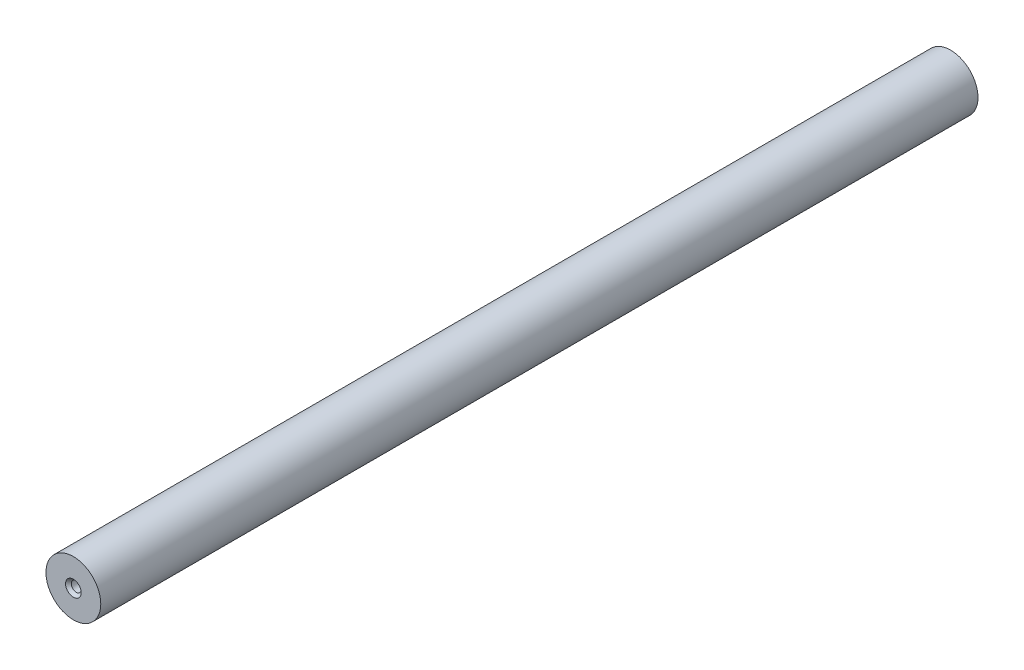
ISO-10303-21;
HEADER;
FILE_DESCRIPTION(('STEP AP214'),'2;1');
FILE_NAME('part.step','',(''),(''),'','','');
FILE_SCHEMA(('AUTOMOTIVE_DESIGN { 1 0 10303 214 1 1 1 1 }'));
ENDSEC;
DATA;
#1=APPLICATION_CONTEXT('core data for automotive mechanical design processes');
#2=APPLICATION_PROTOCOL_DEFINITION('international standard','automotive_design',2000,#1);
#3=PRODUCT_CONTEXT('',#1,'mechanical');
#4=PRODUCT('Part','Part','',(#3));
#5=PRODUCT_RELATED_PRODUCT_CATEGORY('part','',(#4));
#6=PRODUCT_DEFINITION_FORMATION('','',#4);
#7=PRODUCT_DEFINITION_CONTEXT('part definition',#1,'design');
#8=PRODUCT_DEFINITION('design','',#6,#7);
#9=PRODUCT_DEFINITION_SHAPE('','',#8);
#10=(LENGTH_UNIT() NAMED_UNIT(*) SI_UNIT(.MILLI.,.METRE.));
#11=(NAMED_UNIT(*) PLANE_ANGLE_UNIT() SI_UNIT($,.RADIAN.));
#12=(NAMED_UNIT(*) SI_UNIT($,.STERADIAN.) SOLID_ANGLE_UNIT());
#13=UNCERTAINTY_MEASURE_WITH_UNIT(LENGTH_MEASURE(1.E-05),#10,'distance_accuracy_value','');
#14=(GEOMETRIC_REPRESENTATION_CONTEXT(3) GLOBAL_UNCERTAINTY_ASSIGNED_CONTEXT((#13)) GLOBAL_UNIT_ASSIGNED_CONTEXT((#10,
#11,#12)) REPRESENTATION_CONTEXT('',''));
#15=CARTESIAN_POINT('',(0.,0.,0.));
#16=DIRECTION('',(0.,0.,1.));
#17=DIRECTION('',(1.,0.,0.));
#18=AXIS2_PLACEMENT_3D('',#15,#16,#17);
#19=CARTESIAN_POINT('',(-17.8566982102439,5.70677984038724,-304.8));
#20=DIRECTION('',(0.,0.,1.));
#21=DIRECTION('',(1.,0.,0.));
#22=AXIS2_PLACEMENT_3D('',#19,#20,#21);
#23=CYLINDRICAL_SURFACE('',#22,9.525);
#24=CARTESIAN_POINT('',(-17.8566982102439,5.70677984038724,-304.8));
#25=DIRECTION('',(0.,0.,1.));
#26=DIRECTION('',(1.,0.,0.));
#27=AXIS2_PLACEMENT_3D('',#24,#25,#26);
#28=CIRCLE('',#27,9.525);
#29=CARTESIAN_POINT('',(-8.33169821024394,5.70677984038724,-304.8));
#30=VERTEX_POINT('',#29);
#31=EDGE_CURVE('E11',#30,#30,#28,.T.);
#32=CARTESIAN_POINT('',(-17.8566982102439,5.70677984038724,0.));
#33=DIRECTION('',(0.,0.,1.));
#34=DIRECTION('',(1.,0.,0.));
#35=AXIS2_PLACEMENT_3D('',#32,#33,#34);
#36=CIRCLE('',#35,9.525);
#37=CARTESIAN_POINT('',(-8.33169821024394,5.70677984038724,0.));
#38=VERTEX_POINT('',#37);
#39=EDGE_CURVE('E49',#38,#38,#36,.T.);
#40=CARTESIAN_POINT('',(-8.33169821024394,5.70677984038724,-304.8));
#41=CARTESIAN_POINT('',(-8.33169821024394,5.70677984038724,-301.625));
#42=CARTESIAN_POINT('',(-8.33169821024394,5.70677984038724,-298.45));
#43=CARTESIAN_POINT('',(-8.33169821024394,5.70677984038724,-292.1));
#44=CARTESIAN_POINT('',(-8.33169821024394,5.70677984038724,-288.925));
#45=CARTESIAN_POINT('',(-8.33169821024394,5.70677984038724,-282.575));
#46=CARTESIAN_POINT('',(-8.33169821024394,5.70677984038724,-279.4));
#47=CARTESIAN_POINT('',(-8.33169821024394,5.70677984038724,-273.05));
#48=CARTESIAN_POINT('',(-8.33169821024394,5.70677984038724,-269.875));
#49=CARTESIAN_POINT('',(-8.33169821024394,5.70677984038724,-263.525));
#50=CARTESIAN_POINT('',(-8.33169821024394,5.70677984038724,-260.35));
#51=CARTESIAN_POINT('',(-8.33169821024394,5.70677984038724,-254.));
#52=CARTESIAN_POINT('',(-8.33169821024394,5.70677984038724,-250.825));
#53=CARTESIAN_POINT('',(-8.33169821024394,5.70677984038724,-244.475));
#54=CARTESIAN_POINT('',(-8.33169821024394,5.70677984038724,-241.3));
#55=CARTESIAN_POINT('',(-8.33169821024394,5.70677984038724,-234.95));
#56=CARTESIAN_POINT('',(-8.33169821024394,5.70677984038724,-231.775));
#57=CARTESIAN_POINT('',(-8.33169821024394,5.70677984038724,-225.425));
#58=CARTESIAN_POINT('',(-8.33169821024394,5.70677984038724,-222.25));
#59=CARTESIAN_POINT('',(-8.33169821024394,5.70677984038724,-215.9));
#60=CARTESIAN_POINT('',(-8.33169821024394,5.70677984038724,-212.725));
#61=CARTESIAN_POINT('',(-8.33169821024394,5.70677984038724,-206.375));
#62=CARTESIAN_POINT('',(-8.33169821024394,5.70677984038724,-203.2));
#63=CARTESIAN_POINT('',(-8.33169821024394,5.70677984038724,-196.85));
#64=CARTESIAN_POINT('',(-8.33169821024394,5.70677984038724,-193.675));
#65=CARTESIAN_POINT('',(-8.33169821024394,5.70677984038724,-187.325));
#66=CARTESIAN_POINT('',(-8.33169821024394,5.70677984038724,-184.15));
#67=CARTESIAN_POINT('',(-8.33169821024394,5.70677984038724,-177.8));
#68=CARTESIAN_POINT('',(-8.33169821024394,5.70677984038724,-174.625));
#69=CARTESIAN_POINT('',(-8.33169821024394,5.70677984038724,-168.275));
#70=CARTESIAN_POINT('',(-8.33169821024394,5.70677984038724,-165.1));
#71=CARTESIAN_POINT('',(-8.33169821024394,5.70677984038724,-158.75));
#72=CARTESIAN_POINT('',(-8.33169821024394,5.70677984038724,-155.575));
#73=CARTESIAN_POINT('',(-8.33169821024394,5.70677984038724,-149.225));
#74=CARTESIAN_POINT('',(-8.33169821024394,5.70677984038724,-146.05));
#75=CARTESIAN_POINT('',(-8.33169821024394,5.70677984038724,-139.7));
#76=CARTESIAN_POINT('',(-8.33169821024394,5.70677984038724,-136.525));
#77=CARTESIAN_POINT('',(-8.33169821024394,5.70677984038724,-130.175));
#78=CARTESIAN_POINT('',(-8.33169821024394,5.70677984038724,-127.));
#79=CARTESIAN_POINT('',(-8.33169821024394,5.70677984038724,-120.65));
#80=CARTESIAN_POINT('',(-8.33169821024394,5.70677984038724,-117.475));
#81=CARTESIAN_POINT('',(-8.33169821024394,5.70677984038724,-111.125));
#82=CARTESIAN_POINT('',(-8.33169821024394,5.70677984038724,-107.95));
#83=CARTESIAN_POINT('',(-8.33169821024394,5.70677984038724,-101.6));
#84=CARTESIAN_POINT('',(-8.33169821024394,5.70677984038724,-98.425));
#85=CARTESIAN_POINT('',(-8.33169821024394,5.70677984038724,-92.075));
#86=CARTESIAN_POINT('',(-8.33169821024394,5.70677984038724,-88.9));
#87=CARTESIAN_POINT('',(-8.33169821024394,5.70677984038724,-82.55));
#88=CARTESIAN_POINT('',(-8.33169821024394,5.70677984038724,-79.375));
#89=CARTESIAN_POINT('',(-8.33169821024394,5.70677984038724,-73.025));
#90=CARTESIAN_POINT('',(-8.33169821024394,5.70677984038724,-69.85));
#91=CARTESIAN_POINT('',(-8.33169821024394,5.70677984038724,-63.5));
#92=CARTESIAN_POINT('',(-8.33169821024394,5.70677984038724,-60.325));
#93=CARTESIAN_POINT('',(-8.33169821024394,5.70677984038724,-53.975));
#94=CARTESIAN_POINT('',(-8.33169821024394,5.70677984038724,-50.8));
#95=CARTESIAN_POINT('',(-8.33169821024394,5.70677984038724,-44.45));
#96=CARTESIAN_POINT('',(-8.33169821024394,5.70677984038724,-41.275));
#97=CARTESIAN_POINT('',(-8.33169821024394,5.70677984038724,-34.925));
#98=CARTESIAN_POINT('',(-8.33169821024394,5.70677984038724,-31.75));
#99=CARTESIAN_POINT('',(-8.33169821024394,5.70677984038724,-25.4));
#100=CARTESIAN_POINT('',(-8.33169821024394,5.70677984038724,-22.225));
#101=CARTESIAN_POINT('',(-8.33169821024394,5.70677984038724,-15.875));
#102=CARTESIAN_POINT('',(-8.33169821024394,5.70677984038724,-12.7));
#103=CARTESIAN_POINT('',(-8.33169821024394,5.70677984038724,-6.35));
#104=CARTESIAN_POINT('',(-8.33169821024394,5.70677984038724,-3.175));
#105=CARTESIAN_POINT('',(-8.33169821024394,5.70677984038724,0.));
#106=B_SPLINE_CURVE_WITH_KNOTS('',3,(#40,#41,#42,#43,#44,#45,#46,#47,#48,#49,#50,#51,#52,#53,
#54,#55,#56,#57,#58,#59,#60,#61,#62,#63,#64,#65,#66,#67,#68,#69,#70,#71,#72,#73,#74,#75,#76,#77,
#78,#79,#80,#81,#82,#83,#84,#85,#86,#87,#88,#89,#90,#91,#92,#93,#94,#95,#96,#97,#98,#99,#100,
#101,#102,#103,#104,#105),.UNSPECIFIED.,.F.,.F.,(4,2,2,2,2,2,2,2,2,2,2,2,2,2,2,2,2,2,2,2,2,2,2,
2,2,2,2,2,2,2,2,2,4),(0.,9.52500000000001,19.05,28.575,38.1,47.625,57.15,66.675,76.2,
85.7250000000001,95.2500000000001,104.775,114.3,123.825,133.35,142.875,152.4,161.925,171.45,
180.975,190.5,200.025,209.55,219.075,228.6,238.125,247.65,257.175,266.7,276.225,285.75,295.275,
304.8),.UNSPECIFIED.);
#107=EDGE_CURVE('BSEAM46',#30,#38,#106,.T.);
#108=ORIENTED_EDGE('',*,*,#31,.T.);
#109=ORIENTED_EDGE('',*,*,#39,.F.);
#110=ORIENTED_EDGE('',*,*,#107,.T.);
#111=ORIENTED_EDGE('',*,*,#107,.F.);
#112=EDGE_LOOP('',(#108,#110,#109,#111));
#113=FACE_BOUND('',#112,.T.);
#114=ADVANCED_FACE('F46',(#113),#23,.T.);
#115=CARTESIAN_POINT('',(-17.8566982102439,5.70677984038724,-304.8));
#116=DIRECTION('',(0.,0.,1.));
#117=DIRECTION('',(1.,0.,0.));
#118=AXIS2_PLACEMENT_3D('',#115,#116,#117);
#119=PLANE('',#118);
#120=CARTESIAN_POINT('',(-17.8566982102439,5.70677984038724,-304.8));
#121=DIRECTION('',(0.,0.,-1.));
#122=DIRECTION('',(-1.,0.,0.));
#123=AXIS2_PLACEMENT_3D('',#120,#121,#122);
#124=CIRCLE('',#123,2.7178);
#125=CARTESIAN_POINT('',(-20.5744982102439,5.70677984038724,-304.8));
#126=VERTEX_POINT('',#125);
#127=EDGE_CURVE('E81',#126,#126,#124,.T.);
#128=ORIENTED_EDGE('',*,*,#127,.F.);
#129=EDGE_LOOP('',(#128));
#130=FACE_BOUND('',#129,.T.);
#131=ORIENTED_EDGE('',*,*,#31,.F.);
#132=EDGE_LOOP('',(#131));
#133=FACE_BOUND('',#132,.T.);
#134=ADVANCED_FACE('F102',(#130,#133),#119,.F.);
#135=CARTESIAN_POINT('',(-17.8566982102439,5.70677984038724,0.));
#136=DIRECTION('',(0.,0.,1.));
#137=DIRECTION('',(1.,0.,0.));
#138=AXIS2_PLACEMENT_3D('',#135,#136,#137);
#139=PLANE('',#138);
#140=CARTESIAN_POINT('',(-17.8566982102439,5.70677984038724,0.));
#141=DIRECTION('',(0.,0.,1.));
#142=DIRECTION('',(1.,0.,0.));
#143=AXIS2_PLACEMENT_3D('',#140,#141,#142);
#144=CIRCLE('',#143,2.7178);
#145=CARTESIAN_POINT('',(-15.1388982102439,5.70677984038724,0.));
#146=VERTEX_POINT('',#145);
#147=EDGE_CURVE('E71',#146,#146,#144,.T.);
#148=ORIENTED_EDGE('',*,*,#147,.F.);
#149=EDGE_LOOP('',(#148));
#150=FACE_BOUND('',#149,.T.);
#151=ORIENTED_EDGE('',*,*,#39,.T.);
#152=EDGE_LOOP('',(#151));
#153=FACE_BOUND('',#152,.T.);
#154=ADVANCED_FACE('F99',(#150,#153),#139,.T.);
#155=CARTESIAN_POINT('',(-17.8566982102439,5.70677984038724,-12.7));
#156=DIRECTION('',(0.,0.,1.));
#157=DIRECTION('',(1.,0.,0.));
#158=AXIS2_PLACEMENT_3D('',#155,#156,#157);
#159=CONICAL_SURFACE('',#158,1.7272,1.02974425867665);
#160=CARTESIAN_POINT('',(-17.8566982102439,5.70677984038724,-13.7378064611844));
#161=VERTEX_POINT('',#160);
#162=VERTEX_LOOP('',#161);
#163=FACE_BOUND('',#162,.T.);
#164=CARTESIAN_POINT('',(-17.8566982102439,5.70677984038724,-12.7));
#165=DIRECTION('',(0.,0.,1.));
#166=DIRECTION('',(1.,0.,0.));
#167=AXIS2_PLACEMENT_3D('',#164,#165,#166);
#168=CIRCLE('',#167,1.7272);
#169=CARTESIAN_POINT('',(-16.1294982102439,5.70677984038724,-12.7));
#170=VERTEX_POINT('',#169);
#171=EDGE_CURVE('E88',#170,#170,#168,.T.);
#172=ORIENTED_EDGE('',*,*,#171,.T.);
#173=EDGE_LOOP('',(#172));
#174=FACE_BOUND('',#173,.T.);
#175=ADVANCED_FACE('F114',(#163,#174),#159,.F.);
#176=CARTESIAN_POINT('',(-17.8566982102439,5.70677984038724,0.));
#177=DIRECTION('',(0.,0.,1.));
#178=DIRECTION('',(1.,0.,0.));
#179=AXIS2_PLACEMENT_3D('',#176,#177,#178);
#180=CYLINDRICAL_SURFACE('',#179,1.7272);
#181=ORIENTED_EDGE('',*,*,#171,.F.);
#182=EDGE_LOOP('',(#181));
#183=FACE_BOUND('',#182,.T.);
#184=CARTESIAN_POINT('',(-17.8566982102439,5.70677984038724,-0.990600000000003));
#185=DIRECTION('',(0.,0.,1.));
#186=DIRECTION('',(1.,0.,0.));
#187=AXIS2_PLACEMENT_3D('',#184,#185,#186);
#188=CIRCLE('',#187,1.7272);
#189=CARTESIAN_POINT('',(-16.1294982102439,5.70677984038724,-0.990600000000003));
#190=VERTEX_POINT('',#189);
#191=EDGE_CURVE('E78',#190,#190,#188,.T.);
#192=ORIENTED_EDGE('',*,*,#191,.T.);
#193=EDGE_LOOP('',(#192));
#194=FACE_BOUND('',#193,.T.);
#195=ADVANCED_FACE('F120',(#183,#194),#180,.F.);
#196=CARTESIAN_POINT('',(-17.8566982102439,5.70677984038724,0.));
#197=DIRECTION('',(0.,0.,1.));
#198=DIRECTION('',(1.,0.,0.));
#199=AXIS2_PLACEMENT_3D('',#196,#197,#198);
#200=CONICAL_SURFACE('',#199,2.7178,0.785398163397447);
#201=ORIENTED_EDGE('',*,*,#191,.F.);
#202=EDGE_LOOP('',(#201));
#203=FACE_BOUND('',#202,.T.);
#204=ORIENTED_EDGE('',*,*,#147,.T.);
#205=EDGE_LOOP('',(#204));
#206=FACE_BOUND('',#205,.T.);
#207=ADVANCED_FACE('F64',(#203,#206),#200,.F.);
#208=CARTESIAN_POINT('',(-17.8566982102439,5.70677984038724,-292.1));
#209=DIRECTION('',(0.,0.,-1.));
#210=DIRECTION('',(-1.,0.,0.));
#211=AXIS2_PLACEMENT_3D('',#208,#209,#210);
#212=CONICAL_SURFACE('',#211,1.7272,1.02974425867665);
#213=CARTESIAN_POINT('',(-17.8566982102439,5.70677984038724,-291.062193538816));
#214=VERTEX_POINT('',#213);
#215=VERTEX_LOOP('',#214);
#216=FACE_BOUND('',#215,.T.);
#217=CARTESIAN_POINT('',(-17.8566982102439,5.70677984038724,-292.1));
#218=DIRECTION('',(0.,0.,-1.));
#219=DIRECTION('',(-1.,0.,0.));
#220=AXIS2_PLACEMENT_3D('',#217,#218,#219);
#221=CIRCLE('',#220,1.7272);
#222=CARTESIAN_POINT('',(-19.5838982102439,5.70677984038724,-292.1));
#223=VERTEX_POINT('',#222);
#224=EDGE_CURVE('E68',#223,#223,#221,.T.);
#225=ORIENTED_EDGE('',*,*,#224,.T.);
#226=EDGE_LOOP('',(#225));
#227=FACE_BOUND('',#226,.T.);
#228=ADVANCED_FACE('F60',(#216,#227),#212,.F.);
#229=CARTESIAN_POINT('',(-17.8566982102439,5.70677984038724,-304.8));
#230=DIRECTION('',(0.,0.,-1.));
#231=DIRECTION('',(-1.,0.,0.));
#232=AXIS2_PLACEMENT_3D('',#229,#230,#231);
#233=CYLINDRICAL_SURFACE('',#232,1.72719999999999);
#234=ORIENTED_EDGE('',*,*,#224,.F.);
#235=EDGE_LOOP('',(#234));
#236=FACE_BOUND('',#235,.T.);
#237=CARTESIAN_POINT('',(-17.8566982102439,5.70677984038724,-303.8094));
#238=DIRECTION('',(0.,0.,-1.));
#239=DIRECTION('',(-1.,0.,0.));
#240=AXIS2_PLACEMENT_3D('',#237,#238,#239);
#241=CIRCLE('',#240,1.72719999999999);
#242=CARTESIAN_POINT('',(-19.5838982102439,5.70677984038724,-303.8094));
#243=VERTEX_POINT('',#242);
#244=EDGE_CURVE('E72',#243,#243,#241,.T.);
#245=ORIENTED_EDGE('',*,*,#244,.T.);
#246=EDGE_LOOP('',(#245));
#247=FACE_BOUND('',#246,.T.);
#248=ADVANCED_FACE('F63',(#236,#247),#233,.F.);
#249=CARTESIAN_POINT('',(-17.8566982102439,5.70677984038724,-304.8));
#250=DIRECTION('',(0.,0.,-1.));
#251=DIRECTION('',(-1.,0.,0.));
#252=AXIS2_PLACEMENT_3D('',#249,#250,#251);
#253=CONICAL_SURFACE('',#252,2.7178,0.785398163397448);
#254=ORIENTED_EDGE('',*,*,#244,.F.);
#255=EDGE_LOOP('',(#254));
#256=FACE_BOUND('',#255,.T.);
#257=ORIENTED_EDGE('',*,*,#127,.T.);
#258=EDGE_LOOP('',(#257));
#259=FACE_BOUND('',#258,.T.);
#260=ADVANCED_FACE('F129',(#256,#259),#253,.F.);
#261=CLOSED_SHELL('',(#114,#134,#154,#175,#195,#207,#228,#248,#260));
#262=MANIFOLD_SOLID_BREP('B2',#261);
#263=ADVANCED_BREP_SHAPE_REPRESENTATION('',(#18,#262),#14);
#264=SHAPE_DEFINITION_REPRESENTATION(#9,#263);
ENDSEC;
END-ISO-10303-21;
